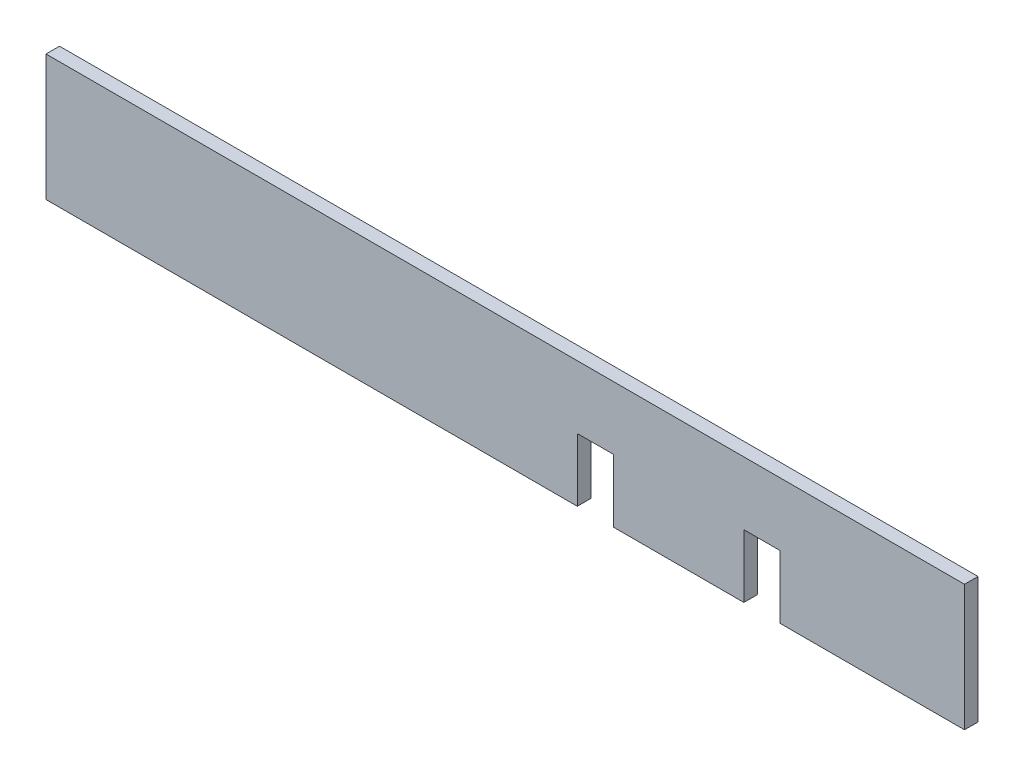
from build123d import *

# Parameters (mm, degrees)
EXTRUSION1_DEPTH = 15


with BuildPart() as part:
    # Esquisse1 → Extrusion1 (new body)
    with BuildSketch(Plane.XY):
        Polygon((0, 0), (0, 140), (1020, 140), (1020, 0), (815, 0), (815, 70), (775, 70), (775, 0), (630, 0), (630, 70), (590, 70), (590, 0), align=None)
    extrude(amount=EXTRUSION1_DEPTH)


solid = part.part
